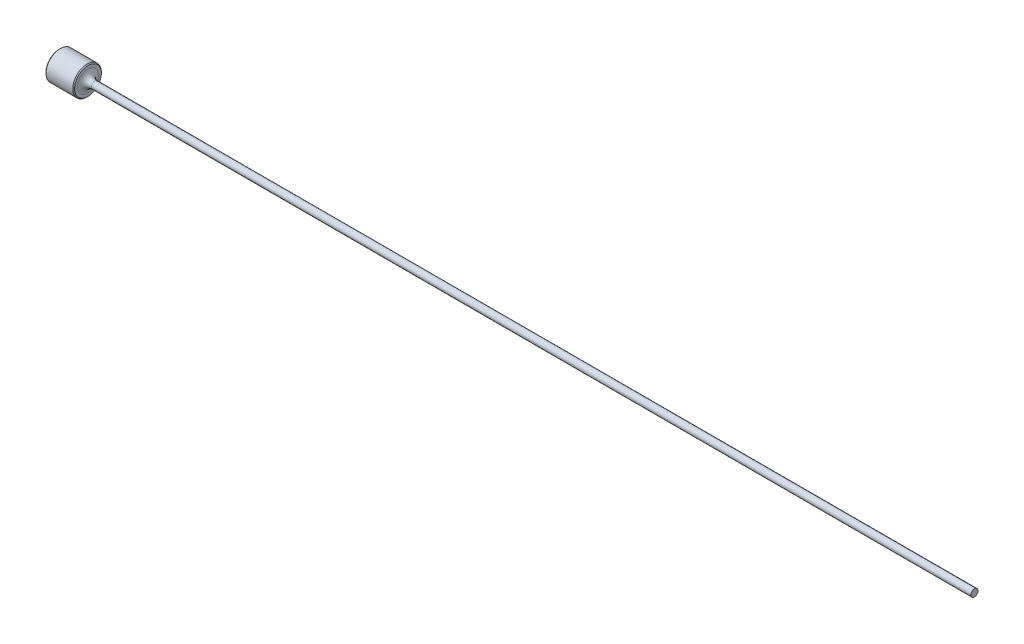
from build123d import *

# Parameters (mm, degrees)
CHAMFER1_SIZE = 0.1016


with BuildPart() as part:
    # Sketch1 → Revolve1 (revolve)
    with BuildSketch(Plane.XY):
        with BuildLine():
            Line((0, 0), (0, 1.5875))
            Line((0, 1.5875), (3.175, 1.5875))
            Line((3.175, 1.5875), (3.175, 1.155065))
            ThreePointArc((3.175, 1.155065), (3.398184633, 0.616249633), (3.937, 0.393065))
            Line((3.937, 0.393065), (101.6, 0.393065))
            Line((101.6, 0.393065), (101.6, 0))
            Line((101.6, 0), (0, 0))
        make_face()
    revolve(axis=Axis((101.6, 0, 0), (-1, 0, 0)))

    # Chamfer1
    chamfer1_edges = [part.edges().sort_by_distance(p)[0] for p in [
        (0, -1.5875, 0),
        (3.175, -1.5875, 0),
    ]]
    chamfer(chamfer1_edges, length=CHAMFER1_SIZE)


solid = part.part
